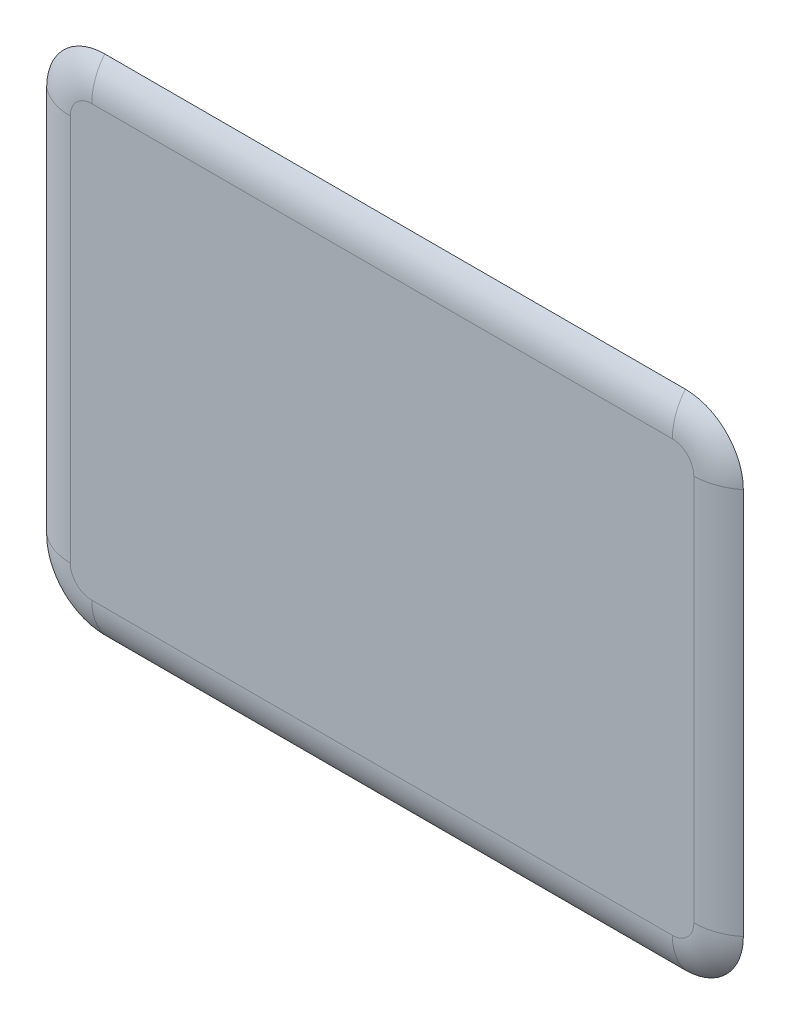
ISO-10303-21;
HEADER;
FILE_DESCRIPTION(('STEP AP214'),'2;1');
FILE_NAME('part.step','',(''),(''),'','','');
FILE_SCHEMA(('AUTOMOTIVE_DESIGN { 1 0 10303 214 1 1 1 1 }'));
ENDSEC;
DATA;
#1=APPLICATION_CONTEXT('core data for automotive mechanical design processes');
#2=APPLICATION_PROTOCOL_DEFINITION('international standard','automotive_design',2000,#1);
#3=PRODUCT_CONTEXT('',#1,'mechanical');
#4=PRODUCT('Part','Part','',(#3));
#5=PRODUCT_RELATED_PRODUCT_CATEGORY('part','',(#4));
#6=PRODUCT_DEFINITION_FORMATION('','',#4);
#7=PRODUCT_DEFINITION_CONTEXT('part definition',#1,'design');
#8=PRODUCT_DEFINITION('design','',#6,#7);
#9=PRODUCT_DEFINITION_SHAPE('','',#8);
#10=(LENGTH_UNIT() NAMED_UNIT(*) SI_UNIT(.MILLI.,.METRE.));
#11=(NAMED_UNIT(*) PLANE_ANGLE_UNIT() SI_UNIT($,.RADIAN.));
#12=(NAMED_UNIT(*) SI_UNIT($,.STERADIAN.) SOLID_ANGLE_UNIT());
#13=UNCERTAINTY_MEASURE_WITH_UNIT(LENGTH_MEASURE(1.E-05),#10,'distance_accuracy_value','');
#14=(GEOMETRIC_REPRESENTATION_CONTEXT(3) GLOBAL_UNCERTAINTY_ASSIGNED_CONTEXT((#13)) GLOBAL_UNIT_ASSIGNED_CONTEXT((#10,
#11,#12)) REPRESENTATION_CONTEXT('',''));
#15=CARTESIAN_POINT('',(0.,0.,0.));
#16=DIRECTION('',(0.,0.,1.));
#17=DIRECTION('',(1.,0.,0.));
#18=AXIS2_PLACEMENT_3D('',#15,#16,#17);
#19=CARTESIAN_POINT('',(75.,-50.,3.35));
#20=DIRECTION('',(0.,0.,1.));
#21=DIRECTION('',(1.,0.,0.));
#22=AXIS2_PLACEMENT_3D('',#19,#20,#21);
#23=PLANE('',#22);
#24=DIRECTION('',(0.,-1.,0.));
#25=VECTOR('',#24,1.);
#26=CARTESIAN_POINT('',(80.5513228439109,49.9999999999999,3.35));
#27=LINE('',#26,#25);
#28=CARTESIAN_POINT('',(80.5513228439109,-50.,3.35));
#29=VERTEX_POINT('',#28);
#30=CARTESIAN_POINT('',(80.5513228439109,49.9999999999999,3.35));
#31=VERTEX_POINT('',#30);
#32=EDGE_CURVE('E42',#29,#31,#27,.F.);
#33=ORIENTED_EDGE('',*,*,#32,.T.);
#34=CARTESIAN_POINT('',(75.,50.,3.35));
#35=DIRECTION('',(0.,0.,1.));
#36=DIRECTION('',(1.,0.,0.));
#37=AXIS2_PLACEMENT_3D('',#34,#35,#36);
#38=CIRCLE('',#37,5.5513228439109);
#39=CARTESIAN_POINT('',(74.9999999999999,55.5513228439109,3.35));
#40=VERTEX_POINT('',#39);
#41=EDGE_CURVE('E11',#31,#40,#38,.T.);
#42=ORIENTED_EDGE('',*,*,#41,.T.);
#43=DIRECTION('',(1.,0.,0.));
#44=VECTOR('',#43,1.);
#45=CARTESIAN_POINT('',(-74.9999999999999,55.5513228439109,3.35));
#46=LINE('',#45,#44);
#47=CARTESIAN_POINT('',(-74.9999999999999,55.5513228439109,3.35));
#48=VERTEX_POINT('',#47);
#49=EDGE_CURVE('E146',#40,#48,#46,.F.);
#50=ORIENTED_EDGE('',*,*,#49,.T.);
#51=CARTESIAN_POINT('',(-75.,50.,3.35));
#52=DIRECTION('',(0.,0.,1.));
#53=DIRECTION('',(1.,0.,0.));
#54=AXIS2_PLACEMENT_3D('',#51,#52,#53);
#55=CIRCLE('',#54,5.5513228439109);
#56=CARTESIAN_POINT('',(-80.5513228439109,50.,3.35));
#57=VERTEX_POINT('',#56);
#58=EDGE_CURVE('E153',#48,#57,#55,.T.);
#59=ORIENTED_EDGE('',*,*,#58,.T.);
#60=DIRECTION('',(0.,1.,0.));
#61=VECTOR('',#60,1.);
#62=CARTESIAN_POINT('',(-80.5513228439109,-49.9999999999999,3.35));
#63=LINE('',#62,#61);
#64=CARTESIAN_POINT('',(-80.5513228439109,-49.9999999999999,3.35));
#65=VERTEX_POINT('',#64);
#66=EDGE_CURVE('E155',#57,#65,#63,.F.);
#67=ORIENTED_EDGE('',*,*,#66,.T.);
#68=CARTESIAN_POINT('',(-75.,-50.,3.35));
#69=DIRECTION('',(0.,0.,1.));
#70=DIRECTION('',(1.,0.,0.));
#71=AXIS2_PLACEMENT_3D('',#68,#69,#70);
#72=CIRCLE('',#71,5.5513228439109);
#73=CARTESIAN_POINT('',(-75.,-55.5513228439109,3.35));
#74=VERTEX_POINT('',#73);
#75=EDGE_CURVE('E142',#65,#74,#72,.T.);
#76=ORIENTED_EDGE('',*,*,#75,.T.);
#77=DIRECTION('',(-1.,0.,0.));
#78=VECTOR('',#77,1.);
#79=CARTESIAN_POINT('',(74.9999999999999,-55.5513228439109,3.35));
#80=LINE('',#79,#78);
#81=CARTESIAN_POINT('',(74.9999999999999,-55.5513228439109,3.35));
#82=VERTEX_POINT('',#81);
#83=EDGE_CURVE('E138',#74,#82,#80,.F.);
#84=ORIENTED_EDGE('',*,*,#83,.T.);
#85=CARTESIAN_POINT('',(75.,-50.,3.35));
#86=DIRECTION('',(0.,0.,1.));
#87=DIRECTION('',(1.,0.,0.));
#88=AXIS2_PLACEMENT_3D('',#85,#86,#87);
#89=CIRCLE('',#88,5.5513228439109);
#90=EDGE_CURVE('E53',#82,#29,#89,.T.);
#91=ORIENTED_EDGE('',*,*,#90,.T.);
#92=EDGE_LOOP('',(#33,#42,#50,#59,#67,#76,#84,#91));
#93=FACE_BOUND('',#92,.T.);
#94=ADVANCED_FACE('F33',(#93),#23,.T.);
#95=CARTESIAN_POINT('',(75.,-50.,0.));
#96=DIRECTION('',(0.,0.,1.));
#97=DIRECTION('',(1.,0.,0.));
#98=AXIS2_PLACEMENT_3D('',#95,#96,#97);
#99=PLANE('',#98);
#100=CARTESIAN_POINT('',(75.,-50.,0.));
#101=DIRECTION('',(0.,0.,1.));
#102=DIRECTION('',(1.,0.,0.));
#103=AXIS2_PLACEMENT_3D('',#100,#101,#102);
#104=CIRCLE('',#103,15.);
#105=CARTESIAN_POINT('',(74.9999999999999,-65.,0.));
#106=VERTEX_POINT('',#105);
#107=CARTESIAN_POINT('',(90.,-49.9999999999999,0.));
#108=VERTEX_POINT('',#107);
#109=EDGE_CURVE('E101',#106,#108,#104,.T.);
#110=ORIENTED_EDGE('',*,*,#109,.F.);
#111=DIRECTION('',(1.,0.,0.));
#112=VECTOR('',#111,1.);
#113=CARTESIAN_POINT('',(-74.9999999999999,-65.,0.));
#114=LINE('',#113,#112);
#115=CARTESIAN_POINT('',(-74.9999999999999,-65.,0.));
#116=VERTEX_POINT('',#115);
#117=EDGE_CURVE('E137',#116,#106,#114,.T.);
#118=ORIENTED_EDGE('',*,*,#117,.F.);
#119=CARTESIAN_POINT('',(-75.,-50.,0.));
#120=DIRECTION('',(0.,0.,1.));
#121=DIRECTION('',(1.,0.,0.));
#122=AXIS2_PLACEMENT_3D('',#119,#120,#121);
#123=CIRCLE('',#122,15.);
#124=CARTESIAN_POINT('',(-90.,-49.9999999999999,0.));
#125=VERTEX_POINT('',#124);
#126=EDGE_CURVE('E143',#125,#116,#123,.T.);
#127=ORIENTED_EDGE('',*,*,#126,.F.);
#128=DIRECTION('',(0.,-1.,0.));
#129=VECTOR('',#128,1.);
#130=CARTESIAN_POINT('',(-90.,49.9999999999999,0.));
#131=LINE('',#130,#129);
#132=CARTESIAN_POINT('',(-90.,49.9999999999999,0.));
#133=VERTEX_POINT('',#132);
#134=EDGE_CURVE('E144',#133,#125,#131,.T.);
#135=ORIENTED_EDGE('',*,*,#134,.F.);
#136=CARTESIAN_POINT('',(-75.,50.,0.));
#137=DIRECTION('',(0.,0.,1.));
#138=DIRECTION('',(1.,0.,0.));
#139=AXIS2_PLACEMENT_3D('',#136,#137,#138);
#140=CIRCLE('',#139,15.);
#141=CARTESIAN_POINT('',(-74.9999999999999,65.,0.));
#142=VERTEX_POINT('',#141);
#143=EDGE_CURVE('E148',#142,#133,#140,.T.);
#144=ORIENTED_EDGE('',*,*,#143,.F.);
#145=DIRECTION('',(-1.,0.,0.));
#146=VECTOR('',#145,1.);
#147=CARTESIAN_POINT('',(-74.9999999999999,65.,0.));
#148=LINE('',#147,#146);
#149=CARTESIAN_POINT('',(74.9999999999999,65.,0.));
#150=VERTEX_POINT('',#149);
#151=EDGE_CURVE('E176',#150,#142,#148,.T.);
#152=ORIENTED_EDGE('',*,*,#151,.F.);
#153=CARTESIAN_POINT('',(75.,50.,0.));
#154=DIRECTION('',(0.,0.,1.));
#155=DIRECTION('',(-1.,0.,0.));
#156=AXIS2_PLACEMENT_3D('',#153,#154,#155);
#157=CIRCLE('',#156,15.);
#158=CARTESIAN_POINT('',(90.,49.9999999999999,0.));
#159=VERTEX_POINT('',#158);
#160=EDGE_CURVE('E104',#159,#150,#157,.T.);
#161=ORIENTED_EDGE('',*,*,#160,.F.);
#162=DIRECTION('',(0.,1.,0.));
#163=VECTOR('',#162,1.);
#164=CARTESIAN_POINT('',(90.,49.9999999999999,0.));
#165=LINE('',#164,#163);
#166=EDGE_CURVE('E98',#108,#159,#165,.T.);
#167=ORIENTED_EDGE('',*,*,#166,.F.);
#168=EDGE_LOOP('',(#110,#118,#127,#135,#144,#152,#161,#167));
#169=FACE_BOUND('',#168,.T.);
#170=ADVANCED_FACE('F100',(#169),#99,.F.);
#171=CARTESIAN_POINT('',(-75.,-50.,-11.65));
#172=DIRECTION('',(0.,0.,-1.));
#173=DIRECTION('',(-1.,0.,0.));
#174=AXIS2_PLACEMENT_3D('',#171,#172,#173);
#175=DEGENERATE_TOROIDAL_SURFACE('',#174,5.5513228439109,15.,.T.);
#176=CARTESIAN_POINT('',(-80.5513228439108,-50.,-11.65));
#177=DIRECTION('',(0.,1.,0.));
#178=DIRECTION('',(-1.,0.,0.));
#179=AXIS2_PLACEMENT_3D('',#176,#177,#178);
#180=CIRCLE('',#179,15.);
#181=EDGE_CURVE('E126',#125,#65,#180,.T.);
#182=ORIENTED_EDGE('',*,*,#181,.F.);
#183=ORIENTED_EDGE('',*,*,#126,.T.);
#184=CARTESIAN_POINT('',(-75.,-55.5513228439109,-11.65));
#185=DIRECTION('',(1.,0.,0.));
#186=DIRECTION('',(0.,1.,0.));
#187=AXIS2_PLACEMENT_3D('',#184,#185,#186);
#188=CIRCLE('',#187,15.);
#189=EDGE_CURVE('E37',#74,#116,#188,.T.);
#190=ORIENTED_EDGE('',*,*,#189,.F.);
#191=ORIENTED_EDGE('',*,*,#75,.F.);
#192=EDGE_LOOP('',(#182,#183,#190,#191));
#193=FACE_BOUND('',#192,.T.);
#194=ADVANCED_FACE('F35',(#193),#175,.T.);
#195=CARTESIAN_POINT('',(-74.9999999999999,-55.5513228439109,-11.65));
#196=DIRECTION('',(1.,0.,0.));
#197=DIRECTION('',(0.,0.,-1.));
#198=AXIS2_PLACEMENT_3D('',#195,#196,#197);
#199=CYLINDRICAL_SURFACE('',#198,15.);
#200=ORIENTED_EDGE('',*,*,#189,.T.);
#201=ORIENTED_EDGE('',*,*,#117,.T.);
#202=CARTESIAN_POINT('',(74.9999999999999,-55.5513228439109,-11.65));
#203=DIRECTION('',(1.,0.,0.));
#204=DIRECTION('',(0.,0.,-1.));
#205=AXIS2_PLACEMENT_3D('',#202,#203,#204);
#206=CIRCLE('',#205,15.);
#207=EDGE_CURVE('E113',#82,#106,#206,.T.);
#208=ORIENTED_EDGE('',*,*,#207,.F.);
#209=ORIENTED_EDGE('',*,*,#83,.F.);
#210=EDGE_LOOP('',(#200,#201,#208,#209));
#211=FACE_BOUND('',#210,.T.);
#212=ADVANCED_FACE('F136',(#211),#199,.T.);
#213=CARTESIAN_POINT('',(-80.5513228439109,49.9999999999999,-11.65));
#214=DIRECTION('',(0.,-1.,0.));
#215=DIRECTION('',(1.,0.,0.));
#216=AXIS2_PLACEMENT_3D('',#213,#214,#215);
#217=CYLINDRICAL_SURFACE('',#216,15.);
#218=ORIENTED_EDGE('',*,*,#181,.T.);
#219=ORIENTED_EDGE('',*,*,#66,.F.);
#220=CARTESIAN_POINT('',(-80.5513228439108,49.9999999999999,-11.65));
#221=DIRECTION('',(0.,1.,0.));
#222=DIRECTION('',(0.,0.,1.));
#223=AXIS2_PLACEMENT_3D('',#220,#221,#222);
#224=CIRCLE('',#223,15.);
#225=EDGE_CURVE('E116',#133,#57,#224,.T.);
#226=ORIENTED_EDGE('',*,*,#225,.F.);
#227=ORIENTED_EDGE('',*,*,#134,.T.);
#228=EDGE_LOOP('',(#218,#219,#226,#227));
#229=FACE_BOUND('',#228,.T.);
#230=ADVANCED_FACE('F179',(#229),#217,.T.);
#231=CARTESIAN_POINT('',(75.,-50.,-11.65));
#232=DIRECTION('',(0.,0.,-1.));
#233=DIRECTION('',(-1.,0.,0.));
#234=AXIS2_PLACEMENT_3D('',#231,#232,#233);
#235=DEGENERATE_TOROIDAL_SURFACE('',#234,5.5513228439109,15.,.T.);
#236=ORIENTED_EDGE('',*,*,#207,.T.);
#237=ORIENTED_EDGE('',*,*,#109,.T.);
#238=CARTESIAN_POINT('',(80.5513228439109,-50.,-11.65));
#239=DIRECTION('',(0.,1.,0.));
#240=DIRECTION('',(-1.,0.,0.));
#241=AXIS2_PLACEMENT_3D('',#238,#239,#240);
#242=CIRCLE('',#241,15.);
#243=EDGE_CURVE('E111',#29,#108,#242,.T.);
#244=ORIENTED_EDGE('',*,*,#243,.F.);
#245=ORIENTED_EDGE('',*,*,#90,.F.);
#246=EDGE_LOOP('',(#236,#237,#244,#245));
#247=FACE_BOUND('',#246,.T.);
#248=ADVANCED_FACE('F110',(#247),#235,.T.);
#249=CARTESIAN_POINT('',(-75.,50.,-11.65));
#250=DIRECTION('',(0.,0.,-1.));
#251=DIRECTION('',(-1.,0.,0.));
#252=AXIS2_PLACEMENT_3D('',#249,#250,#251);
#253=DEGENERATE_TOROIDAL_SURFACE('',#252,5.5513228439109,15.,.T.);
#254=ORIENTED_EDGE('',*,*,#225,.T.);
#255=ORIENTED_EDGE('',*,*,#58,.F.);
#256=CARTESIAN_POINT('',(-75.,55.5513228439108,-11.65));
#257=DIRECTION('',(1.,0.,0.));
#258=DIRECTION('',(0.,1.,0.));
#259=AXIS2_PLACEMENT_3D('',#256,#257,#258);
#260=CIRCLE('',#259,15.);
#261=EDGE_CURVE('E117',#142,#48,#260,.T.);
#262=ORIENTED_EDGE('',*,*,#261,.F.);
#263=ORIENTED_EDGE('',*,*,#143,.T.);
#264=EDGE_LOOP('',(#254,#255,#262,#263));
#265=FACE_BOUND('',#264,.T.);
#266=ADVANCED_FACE('F171',(#265),#253,.T.);
#267=CARTESIAN_POINT('',(80.5513228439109,49.9999999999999,-11.65));
#268=DIRECTION('',(0.,1.,0.));
#269=DIRECTION('',(-1.,0.,0.));
#270=AXIS2_PLACEMENT_3D('',#267,#268,#269);
#271=CYLINDRICAL_SURFACE('',#270,15.);
#272=ORIENTED_EDGE('',*,*,#243,.T.);
#273=ORIENTED_EDGE('',*,*,#166,.T.);
#274=CARTESIAN_POINT('',(80.5513228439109,49.9999999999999,-11.65));
#275=DIRECTION('',(0.,1.,0.));
#276=DIRECTION('',(0.,0.,1.));
#277=AXIS2_PLACEMENT_3D('',#274,#275,#276);
#278=CIRCLE('',#277,15.);
#279=EDGE_CURVE('E122',#31,#159,#278,.T.);
#280=ORIENTED_EDGE('',*,*,#279,.F.);
#281=ORIENTED_EDGE('',*,*,#32,.F.);
#282=EDGE_LOOP('',(#272,#273,#280,#281));
#283=FACE_BOUND('',#282,.T.);
#284=ADVANCED_FACE('F115',(#283),#271,.T.);
#285=CARTESIAN_POINT('',(-74.9999999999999,55.5513228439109,-11.65));
#286=DIRECTION('',(-1.,0.,0.));
#287=DIRECTION('',(0.,0.,1.));
#288=AXIS2_PLACEMENT_3D('',#285,#286,#287);
#289=CYLINDRICAL_SURFACE('',#288,15.);
#290=ORIENTED_EDGE('',*,*,#261,.T.);
#291=ORIENTED_EDGE('',*,*,#49,.F.);
#292=CARTESIAN_POINT('',(74.9999999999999,55.5513228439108,-11.65));
#293=DIRECTION('',(1.,0.,0.));
#294=DIRECTION('',(0.,0.,-1.));
#295=AXIS2_PLACEMENT_3D('',#292,#293,#294);
#296=CIRCLE('',#295,15.);
#297=EDGE_CURVE('E161',#150,#40,#296,.T.);
#298=ORIENTED_EDGE('',*,*,#297,.F.);
#299=ORIENTED_EDGE('',*,*,#151,.T.);
#300=EDGE_LOOP('',(#290,#291,#298,#299));
#301=FACE_BOUND('',#300,.T.);
#302=ADVANCED_FACE('F175',(#301),#289,.T.);
#303=CARTESIAN_POINT('',(75.,50.,-11.65));
#304=DIRECTION('',(0.,0.,-1.));
#305=DIRECTION('',(-1.,0.,0.));
#306=AXIS2_PLACEMENT_3D('',#303,#304,#305);
#307=DEGENERATE_TOROIDAL_SURFACE('',#306,5.5513228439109,15.,.T.);
#308=ORIENTED_EDGE('',*,*,#279,.T.);
#309=ORIENTED_EDGE('',*,*,#160,.T.);
#310=ORIENTED_EDGE('',*,*,#297,.T.);
#311=ORIENTED_EDGE('',*,*,#41,.F.);
#312=EDGE_LOOP('',(#308,#309,#310,#311));
#313=FACE_BOUND('',#312,.T.);
#314=ADVANCED_FACE('F164',(#313),#307,.T.);
#315=CLOSED_SHELL('',(#94,#170,#194,#212,#230,#248,#266,#284,#302,#314));
#316=MANIFOLD_SOLID_BREP('B2',#315);
#317=ADVANCED_BREP_SHAPE_REPRESENTATION('',(#18,#316),#14);
#318=SHAPE_DEFINITION_REPRESENTATION(#9,#317);
ENDSEC;
END-ISO-10303-21;
